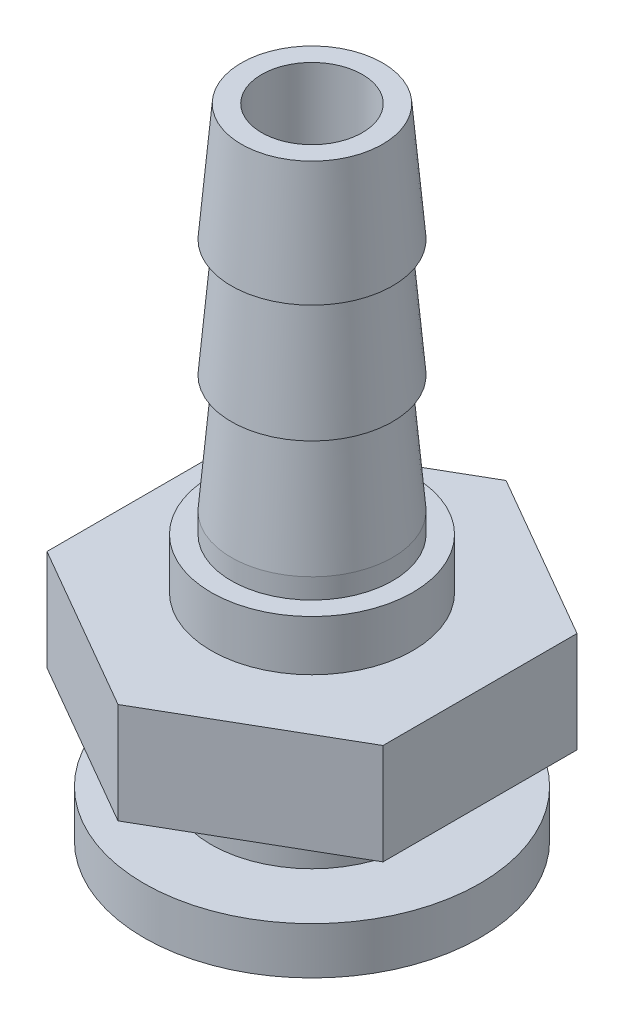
ISO-10303-21;
HEADER;
FILE_DESCRIPTION(('STEP AP214'),'2;1');
FILE_NAME('part.step','',(''),(''),'','','');
FILE_SCHEMA(('AUTOMOTIVE_DESIGN { 1 0 10303 214 1 1 1 1 }'));
ENDSEC;
DATA;
#1=APPLICATION_CONTEXT('core data for automotive mechanical design processes');
#2=APPLICATION_PROTOCOL_DEFINITION('international standard','automotive_design',2000,#1);
#3=PRODUCT_CONTEXT('',#1,'mechanical');
#4=PRODUCT('Part','Part','',(#3));
#5=PRODUCT_RELATED_PRODUCT_CATEGORY('part','',(#4));
#6=PRODUCT_DEFINITION_FORMATION('','',#4);
#7=PRODUCT_DEFINITION_CONTEXT('part definition',#1,'design');
#8=PRODUCT_DEFINITION('design','',#6,#7);
#9=PRODUCT_DEFINITION_SHAPE('','',#8);
#10=(LENGTH_UNIT() NAMED_UNIT(*) SI_UNIT(.MILLI.,.METRE.));
#11=(NAMED_UNIT(*) PLANE_ANGLE_UNIT() SI_UNIT($,.RADIAN.));
#12=(NAMED_UNIT(*) SI_UNIT($,.STERADIAN.) SOLID_ANGLE_UNIT());
#13=UNCERTAINTY_MEASURE_WITH_UNIT(LENGTH_MEASURE(1.E-05),#10,'distance_accuracy_value','');
#14=(GEOMETRIC_REPRESENTATION_CONTEXT(3) GLOBAL_UNCERTAINTY_ASSIGNED_CONTEXT((#13)) GLOBAL_UNIT_ASSIGNED_CONTEXT((#10,
#11,#12)) REPRESENTATION_CONTEXT('',''));
#15=CARTESIAN_POINT('',(0.,0.,0.));
#16=DIRECTION('',(0.,0.,1.));
#17=DIRECTION('',(1.,0.,0.));
#18=AXIS2_PLACEMENT_3D('',#15,#16,#17);
#19=CARTESIAN_POINT('',(0.,0.,0.));
#20=DIRECTION('',(0.,-1.,0.));
#21=DIRECTION('',(0.,0.,-1.));
#22=AXIS2_PLACEMENT_3D('',#19,#20,#21);
#23=CYLINDRICAL_SURFACE('',#22,3.);
#24=CARTESIAN_POINT('',(0.,1.4,0.));
#25=DIRECTION('',(0.,-1.,0.));
#26=DIRECTION('',(0.,0.,-1.));
#27=AXIS2_PLACEMENT_3D('',#24,#25,#26);
#28=CIRCLE('',#27,3.);
#29=CARTESIAN_POINT('',(0.,1.4,-3.));
#30=VERTEX_POINT('',#29);
#31=EDGE_CURVE('E170',#30,#30,#28,.T.);
#32=ORIENTED_EDGE('',*,*,#31,.F.);
#33=EDGE_LOOP('',(#32));
#34=FACE_BOUND('',#33,.T.);
#35=CARTESIAN_POINT('',(0.,3.4,0.));
#36=DIRECTION('',(0.,1.,0.));
#37=DIRECTION('',(0.,0.,1.));
#38=AXIS2_PLACEMENT_3D('',#35,#36,#37);
#39=CIRCLE('',#38,3.);
#40=CARTESIAN_POINT('',(0.,3.4,3.));
#41=VERTEX_POINT('',#40);
#42=EDGE_CURVE('E11',#41,#41,#39,.T.);
#43=ORIENTED_EDGE('',*,*,#42,.F.);
#44=EDGE_LOOP('',(#43));
#45=FACE_BOUND('',#44,.T.);
#46=ADVANCED_FACE('F36',(#34,#45),#23,.T.);
#47=CARTESIAN_POINT('',(0.,0.,0.));
#48=DIRECTION('',(0.,-1.,0.));
#49=DIRECTION('',(0.,0.,-1.));
#50=AXIS2_PLACEMENT_3D('',#47,#48,#49);
#51=CYLINDRICAL_SURFACE('',#50,1.5);
#52=CARTESIAN_POINT('',(0.,19.,0.));
#53=DIRECTION('',(0.,-1.,0.));
#54=DIRECTION('',(0.,0.,-1.));
#55=AXIS2_PLACEMENT_3D('',#52,#53,#54);
#56=CIRCLE('',#55,1.5);
#57=CARTESIAN_POINT('',(0.,19.,-1.5));
#58=VERTEX_POINT('',#57);
#59=EDGE_CURVE('E143',#58,#58,#56,.T.);
#60=ORIENTED_EDGE('',*,*,#59,.F.);
#61=EDGE_LOOP('',(#60));
#62=FACE_BOUND('',#61,.T.);
#63=CARTESIAN_POINT('',(0.,0.,0.));
#64=DIRECTION('',(0.,-1.,0.));
#65=DIRECTION('',(0.,0.,-1.));
#66=AXIS2_PLACEMENT_3D('',#63,#64,#65);
#67=CIRCLE('',#66,1.5);
#68=CARTESIAN_POINT('',(0.,0.,-1.5));
#69=VERTEX_POINT('',#68);
#70=EDGE_CURVE('E46',#69,#69,#67,.T.);
#71=ORIENTED_EDGE('',*,*,#70,.T.);
#72=EDGE_LOOP('',(#71));
#73=FACE_BOUND('',#72,.T.);
#74=ADVANCED_FACE('F38',(#62,#73),#51,.F.);
#75=CARTESIAN_POINT('',(0.,0.,1.5));
#76=DIRECTION('',(0.,1.,0.));
#77=DIRECTION('',(0.,0.,1.));
#78=AXIS2_PLACEMENT_3D('',#75,#76,#77);
#79=PLANE('',#78);
#80=ORIENTED_EDGE('',*,*,#70,.F.);
#81=EDGE_LOOP('',(#80));
#82=FACE_BOUND('',#81,.T.);
#83=CARTESIAN_POINT('',(0.,0.,0.));
#84=DIRECTION('',(0.,-1.,0.));
#85=DIRECTION('',(0.,0.,-1.));
#86=AXIS2_PLACEMENT_3D('',#83,#84,#85);
#87=CIRCLE('',#86,5.);
#88=CARTESIAN_POINT('',(0.,0.,-5.));
#89=VERTEX_POINT('',#88);
#90=EDGE_CURVE('E176',#89,#89,#87,.T.);
#91=ORIENTED_EDGE('',*,*,#90,.T.);
#92=EDGE_LOOP('',(#91));
#93=FACE_BOUND('',#92,.T.);
#94=ADVANCED_FACE('F183',(#82,#93),#79,.F.);
#95=CARTESIAN_POINT('',(0.,0.,0.));
#96=DIRECTION('',(0.,-1.,0.));
#97=DIRECTION('',(0.,0.,-1.));
#98=AXIS2_PLACEMENT_3D('',#95,#96,#97);
#99=CYLINDRICAL_SURFACE('',#98,5.);
#100=ORIENTED_EDGE('',*,*,#90,.F.);
#101=EDGE_LOOP('',(#100));
#102=FACE_BOUND('',#101,.T.);
#103=CARTESIAN_POINT('',(0.,1.4,0.));
#104=DIRECTION('',(0.,-1.,0.));
#105=DIRECTION('',(0.,0.,-1.));
#106=AXIS2_PLACEMENT_3D('',#103,#104,#105);
#107=CIRCLE('',#106,5.);
#108=CARTESIAN_POINT('',(0.,1.4,-5.));
#109=VERTEX_POINT('',#108);
#110=EDGE_CURVE('E173',#109,#109,#107,.T.);
#111=ORIENTED_EDGE('',*,*,#110,.T.);
#112=EDGE_LOOP('',(#111));
#113=FACE_BOUND('',#112,.T.);
#114=ADVANCED_FACE('F186',(#102,#113),#99,.T.);
#115=CARTESIAN_POINT('',(0.,1.4,5.));
#116=DIRECTION('',(0.,-1.,0.));
#117=DIRECTION('',(0.,0.,-1.));
#118=AXIS2_PLACEMENT_3D('',#115,#116,#117);
#119=PLANE('',#118);
#120=ORIENTED_EDGE('',*,*,#110,.F.);
#121=EDGE_LOOP('',(#120));
#122=FACE_BOUND('',#121,.T.);
#123=ORIENTED_EDGE('',*,*,#31,.T.);
#124=EDGE_LOOP('',(#123));
#125=FACE_BOUND('',#124,.T.);
#126=ADVANCED_FACE('F191',(#122,#125),#119,.F.);
#127=CARTESIAN_POINT('',(0.,6.4,0.));
#128=DIRECTION('',(0.,1.,0.));
#129=DIRECTION('',(0.,0.,1.));
#130=AXIS2_PLACEMENT_3D('',#127,#128,#129);
#131=CIRCLE('',#130,3.);
#132=CARTESIAN_POINT('',(0.,6.4,3.));
#133=VERTEX_POINT('',#132);
#134=EDGE_CURVE('E40',#133,#133,#131,.T.);
#135=ORIENTED_EDGE('',*,*,#134,.T.);
#136=EDGE_LOOP('',(#135));
#137=FACE_BOUND('',#136,.T.);
#138=CARTESIAN_POINT('',(0.,7.9,0.));
#139=DIRECTION('',(0.,-1.,0.));
#140=DIRECTION('',(0.,0.,-1.));
#141=AXIS2_PLACEMENT_3D('',#138,#139,#140);
#142=CIRCLE('',#141,3.);
#143=CARTESIAN_POINT('',(0.,7.9,-3.));
#144=VERTEX_POINT('',#143);
#145=EDGE_CURVE('E167',#144,#144,#142,.T.);
#146=ORIENTED_EDGE('',*,*,#145,.T.);
#147=EDGE_LOOP('',(#146));
#148=FACE_BOUND('',#147,.T.);
#149=ADVANCED_FACE('F197',(#137,#148),#23,.T.);
#150=CARTESIAN_POINT('',(0.,7.9,3.));
#151=DIRECTION('',(0.,-1.,0.));
#152=DIRECTION('',(0.,0.,-1.));
#153=AXIS2_PLACEMENT_3D('',#150,#151,#152);
#154=PLANE('',#153);
#155=ORIENTED_EDGE('',*,*,#145,.F.);
#156=EDGE_LOOP('',(#155));
#157=FACE_BOUND('',#156,.T.);
#158=CARTESIAN_POINT('',(0.,7.9,0.));
#159=DIRECTION('',(0.,-1.,0.));
#160=DIRECTION('',(0.,0.,-1.));
#161=AXIS2_PLACEMENT_3D('',#158,#159,#160);
#162=CIRCLE('',#161,2.4);
#163=CARTESIAN_POINT('',(0.,7.9,-2.4));
#164=VERTEX_POINT('',#163);
#165=EDGE_CURVE('E164',#164,#164,#162,.T.);
#166=ORIENTED_EDGE('',*,*,#165,.T.);
#167=EDGE_LOOP('',(#166));
#168=FACE_BOUND('',#167,.T.);
#169=ADVANCED_FACE('F261',(#157,#168),#154,.F.);
#170=CARTESIAN_POINT('',(0.,0.,0.));
#171=DIRECTION('',(0.,-1.,0.));
#172=DIRECTION('',(0.,0.,-1.));
#173=AXIS2_PLACEMENT_3D('',#170,#171,#172);
#174=CYLINDRICAL_SURFACE('',#173,2.4);
#175=ORIENTED_EDGE('',*,*,#165,.F.);
#176=EDGE_LOOP('',(#175));
#177=FACE_BOUND('',#176,.T.);
#178=CARTESIAN_POINT('',(0.,8.5,0.));
#179=DIRECTION('',(0.,-1.,0.));
#180=DIRECTION('',(0.,0.,-1.));
#181=AXIS2_PLACEMENT_3D('',#178,#179,#180);
#182=CIRCLE('',#181,2.4);
#183=CARTESIAN_POINT('',(0.,8.5,-2.4));
#184=VERTEX_POINT('',#183);
#185=EDGE_CURVE('E161',#184,#184,#182,.T.);
#186=ORIENTED_EDGE('',*,*,#185,.T.);
#187=EDGE_LOOP('',(#186));
#188=FACE_BOUND('',#187,.T.);
#189=ADVANCED_FACE('F257',(#177,#188),#174,.T.);
#190=CARTESIAN_POINT('',(0.,12.,0.));
#191=DIRECTION('',(0.,-1.,0.));
#192=DIRECTION('',(0.,0.,-1.));
#193=AXIS2_PLACEMENT_3D('',#190,#191,#192);
#194=CONICAL_SURFACE('',#193,2.1,0.0855052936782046);
#195=ORIENTED_EDGE('',*,*,#185,.F.);
#196=EDGE_LOOP('',(#195));
#197=FACE_BOUND('',#196,.T.);
#198=CARTESIAN_POINT('',(0.,12.,0.));
#199=DIRECTION('',(0.,-1.,0.));
#200=DIRECTION('',(0.,0.,-1.));
#201=AXIS2_PLACEMENT_3D('',#198,#199,#200);
#202=CIRCLE('',#201,2.1);
#203=CARTESIAN_POINT('',(0.,12.,-2.1));
#204=VERTEX_POINT('',#203);
#205=EDGE_CURVE('E158',#204,#204,#202,.T.);
#206=ORIENTED_EDGE('',*,*,#205,.T.);
#207=EDGE_LOOP('',(#206));
#208=FACE_BOUND('',#207,.T.);
#209=ADVANCED_FACE('F253',(#197,#208),#194,.T.);
#210=CARTESIAN_POINT('',(0.,12.,2.1));
#211=DIRECTION('',(0.,1.,0.));
#212=DIRECTION('',(0.,0.,1.));
#213=AXIS2_PLACEMENT_3D('',#210,#211,#212);
#214=PLANE('',#213);
#215=ORIENTED_EDGE('',*,*,#205,.F.);
#216=EDGE_LOOP('',(#215));
#217=FACE_BOUND('',#216,.T.);
#218=CARTESIAN_POINT('',(0.,12.,0.));
#219=DIRECTION('',(0.,-1.,0.));
#220=DIRECTION('',(0.,0.,-1.));
#221=AXIS2_PLACEMENT_3D('',#218,#219,#220);
#222=CIRCLE('',#221,2.4);
#223=CARTESIAN_POINT('',(0.,12.,-2.4));
#224=VERTEX_POINT('',#223);
#225=EDGE_CURVE('E155',#224,#224,#222,.T.);
#226=ORIENTED_EDGE('',*,*,#225,.T.);
#227=EDGE_LOOP('',(#226));
#228=FACE_BOUND('',#227,.T.);
#229=ADVANCED_FACE('F249',(#217,#228),#214,.F.);
#230=CARTESIAN_POINT('',(0.,15.5,0.));
#231=DIRECTION('',(0.,-1.,0.));
#232=DIRECTION('',(0.,0.,-1.));
#233=AXIS2_PLACEMENT_3D('',#230,#231,#232);
#234=CONICAL_SURFACE('',#233,2.1,0.0855052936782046);
#235=ORIENTED_EDGE('',*,*,#225,.F.);
#236=EDGE_LOOP('',(#235));
#237=FACE_BOUND('',#236,.T.);
#238=CARTESIAN_POINT('',(0.,15.5,0.));
#239=DIRECTION('',(0.,-1.,0.));
#240=DIRECTION('',(0.,0.,-1.));
#241=AXIS2_PLACEMENT_3D('',#238,#239,#240);
#242=CIRCLE('',#241,2.1);
#243=CARTESIAN_POINT('',(0.,15.5,-2.1));
#244=VERTEX_POINT('',#243);
#245=EDGE_CURVE('E152',#244,#244,#242,.T.);
#246=ORIENTED_EDGE('',*,*,#245,.T.);
#247=EDGE_LOOP('',(#246));
#248=FACE_BOUND('',#247,.T.);
#249=ADVANCED_FACE('F245',(#237,#248),#234,.T.);
#250=CARTESIAN_POINT('',(0.,15.5,2.1));
#251=DIRECTION('',(0.,1.,0.));
#252=DIRECTION('',(0.,0.,1.));
#253=AXIS2_PLACEMENT_3D('',#250,#251,#252);
#254=PLANE('',#253);
#255=ORIENTED_EDGE('',*,*,#245,.F.);
#256=EDGE_LOOP('',(#255));
#257=FACE_BOUND('',#256,.T.);
#258=CARTESIAN_POINT('',(0.,15.5,0.));
#259=DIRECTION('',(0.,-1.,0.));
#260=DIRECTION('',(0.,0.,-1.));
#261=AXIS2_PLACEMENT_3D('',#258,#259,#260);
#262=CIRCLE('',#261,2.4);
#263=CARTESIAN_POINT('',(0.,15.5,-2.4));
#264=VERTEX_POINT('',#263);
#265=EDGE_CURVE('E149',#264,#264,#262,.T.);
#266=ORIENTED_EDGE('',*,*,#265,.T.);
#267=EDGE_LOOP('',(#266));
#268=FACE_BOUND('',#267,.T.);
#269=ADVANCED_FACE('F241',(#257,#268),#254,.F.);
#270=CARTESIAN_POINT('',(0.,19.,0.));
#271=DIRECTION('',(0.,-1.,0.));
#272=DIRECTION('',(0.,0.,-1.));
#273=AXIS2_PLACEMENT_3D('',#270,#271,#272);
#274=CONICAL_SURFACE('',#273,2.1,0.0855052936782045);
#275=ORIENTED_EDGE('',*,*,#265,.F.);
#276=EDGE_LOOP('',(#275));
#277=FACE_BOUND('',#276,.T.);
#278=CARTESIAN_POINT('',(0.,19.,0.));
#279=DIRECTION('',(0.,-1.,0.));
#280=DIRECTION('',(0.,0.,-1.));
#281=AXIS2_PLACEMENT_3D('',#278,#279,#280);
#282=CIRCLE('',#281,2.1);
#283=CARTESIAN_POINT('',(0.,19.,-2.1));
#284=VERTEX_POINT('',#283);
#285=EDGE_CURVE('E146',#284,#284,#282,.T.);
#286=ORIENTED_EDGE('',*,*,#285,.T.);
#287=EDGE_LOOP('',(#286));
#288=FACE_BOUND('',#287,.T.);
#289=ADVANCED_FACE('F237',(#277,#288),#274,.T.);
#290=CARTESIAN_POINT('',(0.,19.,2.1));
#291=DIRECTION('',(0.,-1.,0.));
#292=DIRECTION('',(0.,0.,-1.));
#293=AXIS2_PLACEMENT_3D('',#290,#291,#292);
#294=PLANE('',#293);
#295=ORIENTED_EDGE('',*,*,#285,.F.);
#296=EDGE_LOOP('',(#295));
#297=FACE_BOUND('',#296,.T.);
#298=ORIENTED_EDGE('',*,*,#59,.T.);
#299=EDGE_LOOP('',(#298));
#300=FACE_BOUND('',#299,.T.);
#301=ADVANCED_FACE('F218',(#297,#300),#294,.F.);
#302=CARTESIAN_POINT('',(0.,6.4,0.));
#303=DIRECTION('',(0.,1.,0.));
#304=DIRECTION('',(0.,0.,1.));
#305=AXIS2_PLACEMENT_3D('',#302,#303,#304);
#306=PLANE('',#305);
#307=DIRECTION('',(0.866025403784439,0.,-0.5));
#308=VECTOR('',#307,1.);
#309=CARTESIAN_POINT('',(0.,6.4,5.77350269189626));
#310=LINE('',#309,#308);
#311=CARTESIAN_POINT('',(0.,6.4,5.77350269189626));
#312=VERTEX_POINT('',#311);
#313=CARTESIAN_POINT('',(5.,6.4,2.88675134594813));
#314=VERTEX_POINT('',#313);
#315=EDGE_CURVE('E134',#312,#314,#310,.T.);
#316=ORIENTED_EDGE('',*,*,#315,.T.);
#317=DIRECTION('',(0.,0.,-1.));
#318=VECTOR('',#317,1.);
#319=CARTESIAN_POINT('',(5.,6.4,2.88675134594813));
#320=LINE('',#319,#318);
#321=CARTESIAN_POINT('',(5.,6.4,-2.88675134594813));
#322=VERTEX_POINT('',#321);
#323=EDGE_CURVE('E92',#314,#322,#320,.T.);
#324=ORIENTED_EDGE('',*,*,#323,.T.);
#325=DIRECTION('',(-0.866025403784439,0.,-0.5));
#326=VECTOR('',#325,1.);
#327=CARTESIAN_POINT('',(5.,6.4,-2.88675134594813));
#328=LINE('',#327,#326);
#329=CARTESIAN_POINT('',(0.,6.4,-5.77350269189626));
#330=VERTEX_POINT('',#329);
#331=EDGE_CURVE('E106',#322,#330,#328,.T.);
#332=ORIENTED_EDGE('',*,*,#331,.T.);
#333=DIRECTION('',(-0.866025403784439,0.,0.5));
#334=VECTOR('',#333,1.);
#335=CARTESIAN_POINT('',(0.,6.4,-5.77350269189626));
#336=LINE('',#335,#334);
#337=CARTESIAN_POINT('',(-5.,6.4,-2.88675134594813));
#338=VERTEX_POINT('',#337);
#339=EDGE_CURVE('E99',#330,#338,#336,.T.);
#340=ORIENTED_EDGE('',*,*,#339,.T.);
#341=DIRECTION('',(0.,0.,1.));
#342=VECTOR('',#341,1.);
#343=CARTESIAN_POINT('',(-5.,6.4,-2.88675134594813));
#344=LINE('',#343,#342);
#345=CARTESIAN_POINT('',(-5.,6.4,2.88675134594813));
#346=VERTEX_POINT('',#345);
#347=EDGE_CURVE('E104',#338,#346,#344,.T.);
#348=ORIENTED_EDGE('',*,*,#347,.T.);
#349=DIRECTION('',(0.866025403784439,0.,0.5));
#350=VECTOR('',#349,1.);
#351=CARTESIAN_POINT('',(-5.,6.4,2.88675134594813));
#352=LINE('',#351,#350);
#353=EDGE_CURVE('E54',#346,#312,#352,.T.);
#354=ORIENTED_EDGE('',*,*,#353,.T.);
#355=EDGE_LOOP('',(#316,#324,#332,#340,#348,#354));
#356=FACE_BOUND('',#355,.T.);
#357=ORIENTED_EDGE('',*,*,#134,.F.);
#358=EDGE_LOOP('',(#357));
#359=FACE_BOUND('',#358,.T.);
#360=ADVANCED_FACE('F101',(#356,#359),#306,.T.);
#361=CARTESIAN_POINT('',(0.,3.4,0.));
#362=DIRECTION('',(0.,1.,0.));
#363=DIRECTION('',(0.,0.,1.));
#364=AXIS2_PLACEMENT_3D('',#361,#362,#363);
#365=PLANE('',#364);
#366=DIRECTION('',(0.866025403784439,0.,-0.5));
#367=VECTOR('',#366,1.);
#368=CARTESIAN_POINT('',(0.,3.4,5.77350269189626));
#369=LINE('',#368,#367);
#370=CARTESIAN_POINT('',(0.,3.4,5.77350269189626));
#371=VERTEX_POINT('',#370);
#372=CARTESIAN_POINT('',(5.,3.4,2.88675134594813));
#373=VERTEX_POINT('',#372);
#374=EDGE_CURVE('E124',#371,#373,#369,.T.);
#375=ORIENTED_EDGE('',*,*,#374,.F.);
#376=DIRECTION('',(0.866025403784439,0.,0.5));
#377=VECTOR('',#376,1.);
#378=CARTESIAN_POINT('',(-5.,3.4,2.88675134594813));
#379=LINE('',#378,#377);
#380=CARTESIAN_POINT('',(-5.,3.4,2.88675134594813));
#381=VERTEX_POINT('',#380);
#382=EDGE_CURVE('E83',#381,#371,#379,.T.);
#383=ORIENTED_EDGE('',*,*,#382,.F.);
#384=DIRECTION('',(0.,0.,1.));
#385=VECTOR('',#384,1.);
#386=CARTESIAN_POINT('',(-5.,3.4,-2.88675134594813));
#387=LINE('',#386,#385);
#388=CARTESIAN_POINT('',(-5.,3.4,-2.88675134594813));
#389=VERTEX_POINT('',#388);
#390=EDGE_CURVE('E77',#389,#381,#387,.T.);
#391=ORIENTED_EDGE('',*,*,#390,.F.);
#392=DIRECTION('',(-0.866025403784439,0.,0.5));
#393=VECTOR('',#392,1.);
#394=CARTESIAN_POINT('',(0.,3.4,-5.77350269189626));
#395=LINE('',#394,#393);
#396=CARTESIAN_POINT('',(0.,3.4,-5.77350269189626));
#397=VERTEX_POINT('',#396);
#398=EDGE_CURVE('E114',#397,#389,#395,.T.);
#399=ORIENTED_EDGE('',*,*,#398,.F.);
#400=DIRECTION('',(-0.866025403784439,0.,-0.5));
#401=VECTOR('',#400,1.);
#402=CARTESIAN_POINT('',(5.,3.4,-2.88675134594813));
#403=LINE('',#402,#401);
#404=CARTESIAN_POINT('',(5.,3.4,-2.88675134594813));
#405=VERTEX_POINT('',#404);
#406=EDGE_CURVE('E129',#405,#397,#403,.T.);
#407=ORIENTED_EDGE('',*,*,#406,.F.);
#408=DIRECTION('',(0.,0.,-1.));
#409=VECTOR('',#408,1.);
#410=CARTESIAN_POINT('',(5.,3.4,2.88675134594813));
#411=LINE('',#410,#409);
#412=EDGE_CURVE('E127',#373,#405,#411,.T.);
#413=ORIENTED_EDGE('',*,*,#412,.F.);
#414=EDGE_LOOP('',(#375,#383,#391,#399,#407,#413));
#415=FACE_BOUND('',#414,.T.);
#416=ORIENTED_EDGE('',*,*,#42,.T.);
#417=EDGE_LOOP('',(#416));
#418=FACE_BOUND('',#417,.T.);
#419=ADVANCED_FACE('F206',(#415,#418),#365,.F.);
#420=CARTESIAN_POINT('',(0.,6.4,5.77350269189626));
#421=DIRECTION('',(-0.5,0.,-0.866025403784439));
#422=DIRECTION('',(-0.866025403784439,0.,0.5));
#423=AXIS2_PLACEMENT_3D('',#420,#421,#422);
#424=PLANE('',#423);
#425=ORIENTED_EDGE('',*,*,#374,.T.);
#426=DIRECTION('',(0.,-1.,0.));
#427=VECTOR('',#426,1.);
#428=CARTESIAN_POINT('',(5.,6.4,2.88675134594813));
#429=LINE('',#428,#427);
#430=EDGE_CURVE('E141',#314,#373,#429,.T.);
#431=ORIENTED_EDGE('',*,*,#430,.F.);
#432=ORIENTED_EDGE('',*,*,#315,.F.);
#433=DIRECTION('',(0.,-1.,0.));
#434=VECTOR('',#433,1.);
#435=CARTESIAN_POINT('',(0.,6.4,5.77350269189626));
#436=LINE('',#435,#434);
#437=EDGE_CURVE('E120',#312,#371,#436,.T.);
#438=ORIENTED_EDGE('',*,*,#437,.T.);
#439=EDGE_LOOP('',(#425,#431,#432,#438));
#440=FACE_BOUND('',#439,.T.);
#441=ADVANCED_FACE('F208',(#440),#424,.F.);
#442=CARTESIAN_POINT('',(5.,6.4,2.88675134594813));
#443=DIRECTION('',(-1.,0.,0.));
#444=DIRECTION('',(0.,0.,1.));
#445=AXIS2_PLACEMENT_3D('',#442,#443,#444);
#446=PLANE('',#445);
#447=ORIENTED_EDGE('',*,*,#412,.T.);
#448=DIRECTION('',(0.,-1.,0.));
#449=VECTOR('',#448,1.);
#450=CARTESIAN_POINT('',(5.,6.4,-2.88675134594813));
#451=LINE('',#450,#449);
#452=EDGE_CURVE('E138',#322,#405,#451,.T.);
#453=ORIENTED_EDGE('',*,*,#452,.F.);
#454=ORIENTED_EDGE('',*,*,#323,.F.);
#455=ORIENTED_EDGE('',*,*,#430,.T.);
#456=EDGE_LOOP('',(#447,#453,#454,#455));
#457=FACE_BOUND('',#456,.T.);
#458=ADVANCED_FACE('F215',(#457),#446,.F.);
#459=CARTESIAN_POINT('',(5.,6.4,-2.88675134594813));
#460=DIRECTION('',(-0.5,0.,0.866025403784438));
#461=DIRECTION('',(0.866025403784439,0.,0.5));
#462=AXIS2_PLACEMENT_3D('',#459,#460,#461);
#463=PLANE('',#462);
#464=ORIENTED_EDGE('',*,*,#406,.T.);
#465=DIRECTION('',(0.,-1.,0.));
#466=VECTOR('',#465,1.);
#467=CARTESIAN_POINT('',(0.,6.4,-5.77350269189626));
#468=LINE('',#467,#466);
#469=EDGE_CURVE('E115',#330,#397,#468,.T.);
#470=ORIENTED_EDGE('',*,*,#469,.F.);
#471=ORIENTED_EDGE('',*,*,#331,.F.);
#472=ORIENTED_EDGE('',*,*,#452,.T.);
#473=EDGE_LOOP('',(#464,#470,#471,#472));
#474=FACE_BOUND('',#473,.T.);
#475=ADVANCED_FACE('F229',(#474),#463,.F.);
#476=CARTESIAN_POINT('',(0.,6.4,-5.77350269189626));
#477=DIRECTION('',(0.5,0.,0.866025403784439));
#478=DIRECTION('',(0.866025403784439,0.,-0.5));
#479=AXIS2_PLACEMENT_3D('',#476,#477,#478);
#480=PLANE('',#479);
#481=ORIENTED_EDGE('',*,*,#398,.T.);
#482=DIRECTION('',(0.,-1.,0.));
#483=VECTOR('',#482,1.);
#484=CARTESIAN_POINT('',(-5.,6.4,-2.88675134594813));
#485=LINE('',#484,#483);
#486=EDGE_CURVE('E111',#338,#389,#485,.T.);
#487=ORIENTED_EDGE('',*,*,#486,.F.);
#488=ORIENTED_EDGE('',*,*,#339,.F.);
#489=ORIENTED_EDGE('',*,*,#469,.T.);
#490=EDGE_LOOP('',(#481,#487,#488,#489));
#491=FACE_BOUND('',#490,.T.);
#492=ADVANCED_FACE('F112',(#491),#480,.F.);
#493=CARTESIAN_POINT('',(-5.,6.4,-2.88675134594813));
#494=DIRECTION('',(1.,0.,0.));
#495=DIRECTION('',(0.,0.,-1.));
#496=AXIS2_PLACEMENT_3D('',#493,#494,#495);
#497=PLANE('',#496);
#498=ORIENTED_EDGE('',*,*,#390,.T.);
#499=DIRECTION('',(0.,-1.,0.));
#500=VECTOR('',#499,1.);
#501=CARTESIAN_POINT('',(-5.,6.4,2.88675134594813));
#502=LINE('',#501,#500);
#503=EDGE_CURVE('E116',#346,#381,#502,.T.);
#504=ORIENTED_EDGE('',*,*,#503,.F.);
#505=ORIENTED_EDGE('',*,*,#347,.F.);
#506=ORIENTED_EDGE('',*,*,#486,.T.);
#507=EDGE_LOOP('',(#498,#504,#505,#506));
#508=FACE_BOUND('',#507,.T.);
#509=ADVANCED_FACE('F118',(#508),#497,.F.);
#510=CARTESIAN_POINT('',(-5.,6.4,2.88675134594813));
#511=DIRECTION('',(0.5,0.,-0.866025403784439));
#512=DIRECTION('',(-0.866025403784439,0.,-0.5));
#513=AXIS2_PLACEMENT_3D('',#510,#511,#512);
#514=PLANE('',#513);
#515=ORIENTED_EDGE('',*,*,#382,.T.);
#516=ORIENTED_EDGE('',*,*,#437,.F.);
#517=ORIENTED_EDGE('',*,*,#353,.F.);
#518=ORIENTED_EDGE('',*,*,#503,.T.);
#519=EDGE_LOOP('',(#515,#516,#517,#518));
#520=FACE_BOUND('',#519,.T.);
#521=ADVANCED_FACE('F222',(#520),#514,.F.);
#522=CLOSED_SHELL('',(#46,#74,#94,#114,#126,#149,#169,#189,#209,#229,#249,#269,#289,#301,#360,
#419,#441,#458,#475,#492,#509,#521));
#523=MANIFOLD_SOLID_BREP('B2',#522);
#524=ADVANCED_BREP_SHAPE_REPRESENTATION('',(#18,#523),#14);
#525=SHAPE_DEFINITION_REPRESENTATION(#9,#524);
ENDSEC;
END-ISO-10303-21;
